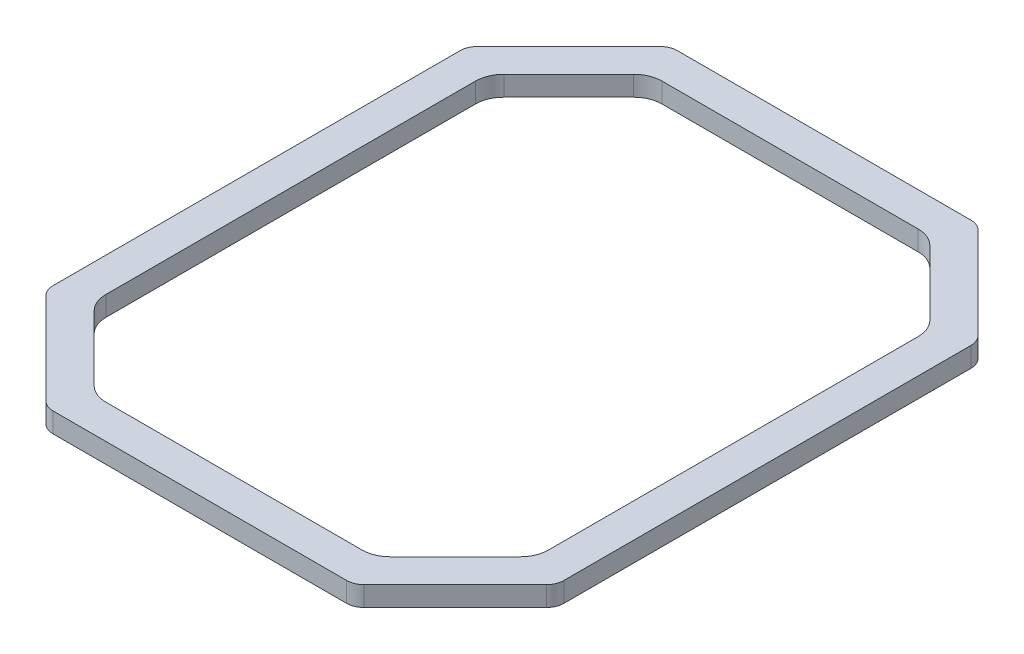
ISO-10303-21;
HEADER;
FILE_DESCRIPTION(('STEP AP214'),'2;1');
FILE_NAME('part.step','',(''),(''),'','','');
FILE_SCHEMA(('AUTOMOTIVE_DESIGN { 1 0 10303 214 1 1 1 1 }'));
ENDSEC;
DATA;
#1=APPLICATION_CONTEXT('core data for automotive mechanical design processes');
#2=APPLICATION_PROTOCOL_DEFINITION('international standard','automotive_design',2000,#1);
#3=PRODUCT_CONTEXT('',#1,'mechanical');
#4=PRODUCT('Part','Part','',(#3));
#5=PRODUCT_RELATED_PRODUCT_CATEGORY('part','',(#4));
#6=PRODUCT_DEFINITION_FORMATION('','',#4);
#7=PRODUCT_DEFINITION_CONTEXT('part definition',#1,'design');
#8=PRODUCT_DEFINITION('design','',#6,#7);
#9=PRODUCT_DEFINITION_SHAPE('','',#8);
#10=(LENGTH_UNIT() NAMED_UNIT(*) SI_UNIT(.MILLI.,.METRE.));
#11=(NAMED_UNIT(*) PLANE_ANGLE_UNIT() SI_UNIT($,.RADIAN.));
#12=(NAMED_UNIT(*) SI_UNIT($,.STERADIAN.) SOLID_ANGLE_UNIT());
#13=UNCERTAINTY_MEASURE_WITH_UNIT(LENGTH_MEASURE(1.E-05),#10,'distance_accuracy_value','');
#14=(GEOMETRIC_REPRESENTATION_CONTEXT(3) GLOBAL_UNCERTAINTY_ASSIGNED_CONTEXT((#13)) GLOBAL_UNIT_ASSIGNED_CONTEXT((#10,
#11,#12)) REPRESENTATION_CONTEXT('',''));
#15=CARTESIAN_POINT('',(0.,0.,0.));
#16=DIRECTION('',(0.,0.,1.));
#17=DIRECTION('',(1.,0.,0.));
#18=AXIS2_PLACEMENT_3D('',#15,#16,#17);
#19=CARTESIAN_POINT('',(-898.854903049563,1.75,-1730.13027438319));
#20=DIRECTION('',(0.,1.,0.));
#21=DIRECTION('',(0.,0.,1.));
#22=AXIS2_PLACEMENT_3D('',#19,#20,#21);
#23=PLANE('',#22);
#24=CARTESIAN_POINT('',(-898.854903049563,1.75,-1730.13027438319));
#25=DIRECTION('',(0.,1.,0.));
#26=DIRECTION('',(0.,0.,1.));
#27=AXIS2_PLACEMENT_3D('',#24,#25,#26);
#28=CIRCLE('',#27,1.50000000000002);
#29=CARTESIAN_POINT('',(-898.854903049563,1.75,-1731.63027438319));
#30=VERTEX_POINT('',#29);
#31=CARTESIAN_POINT('',(-899.915563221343,1.75,-1731.19093455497));
#32=VERTEX_POINT('',#31);
#33=EDGE_CURVE('E369',#30,#32,#28,.T.);
#34=ORIENTED_EDGE('',*,*,#33,.T.);
#35=DIRECTION('',(-0.707106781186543,0.,0.707106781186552));
#36=VECTOR('',#35,1.);
#37=CARTESIAN_POINT('',(-899.915563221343,1.75,-1731.19093455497));
#38=LINE('',#37,#36);
#39=CARTESIAN_POINT('',(-907.976580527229,1.75,-1723.12991724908));
#40=VERTEX_POINT('',#39);
#41=EDGE_CURVE('E372',#32,#40,#38,.T.);
#42=ORIENTED_EDGE('',*,*,#41,.T.);
#43=CARTESIAN_POINT('',(-906.915920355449,1.75,-1722.0692570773));
#44=DIRECTION('',(0.,1.,0.));
#45=DIRECTION('',(0.,0.,1.));
#46=AXIS2_PLACEMENT_3D('',#43,#44,#45);
#47=CIRCLE('',#46,1.50000000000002);
#48=CARTESIAN_POINT('',(-908.415920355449,1.75,-1722.0692570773));
#49=VERTEX_POINT('',#48);
#50=EDGE_CURVE('E375',#40,#49,#47,.T.);
#51=ORIENTED_EDGE('',*,*,#50,.T.);
#52=DIRECTION('',(0.,0.,1.));
#53=VECTOR('',#52,1.);
#54=CARTESIAN_POINT('',(-908.415920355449,1.75,-1722.0692570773));
#55=LINE('',#54,#53);
#56=CARTESIAN_POINT('',(-908.415920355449,1.75,-1686.19129168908));
#57=VERTEX_POINT('',#56);
#58=EDGE_CURVE('E377',#49,#57,#55,.T.);
#59=ORIENTED_EDGE('',*,*,#58,.T.);
#60=CARTESIAN_POINT('',(-906.915920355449,1.75,-1686.19129168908));
#61=DIRECTION('',(0.,1.,0.));
#62=DIRECTION('',(0.,0.,1.));
#63=AXIS2_PLACEMENT_3D('',#60,#61,#62);
#64=CIRCLE('',#63,1.50000000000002);
#65=CARTESIAN_POINT('',(-907.976580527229,1.75,-1685.1306315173));
#66=VERTEX_POINT('',#65);
#67=EDGE_CURVE('E379',#57,#66,#64,.T.);
#68=ORIENTED_EDGE('',*,*,#67,.T.);
#69=DIRECTION('',(0.707106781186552,0.,0.707106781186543));
#70=VECTOR('',#69,1.);
#71=CARTESIAN_POINT('',(-907.976580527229,1.75,-1685.1306315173));
#72=LINE('',#71,#70);
#73=CARTESIAN_POINT('',(-899.915563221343,1.75,-1677.06961421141));
#74=VERTEX_POINT('',#73);
#75=EDGE_CURVE('E381',#66,#74,#72,.T.);
#76=ORIENTED_EDGE('',*,*,#75,.T.);
#77=CARTESIAN_POINT('',(-898.854903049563,1.75,-1678.13027438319));
#78=DIRECTION('',(0.,1.,0.));
#79=DIRECTION('',(0.,0.,1.));
#80=AXIS2_PLACEMENT_3D('',#77,#78,#79);
#81=CIRCLE('',#80,1.50000000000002);
#82=CARTESIAN_POINT('',(-898.854903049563,1.75,-1676.63027438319));
#83=VERTEX_POINT('',#82);
#84=EDGE_CURVE('E383',#74,#83,#81,.T.);
#85=ORIENTED_EDGE('',*,*,#84,.T.);
#86=DIRECTION('',(1.,0.,0.));
#87=VECTOR('',#86,1.);
#88=CARTESIAN_POINT('',(-898.854903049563,1.75,-1676.63027438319));
#89=LINE('',#88,#87);
#90=CARTESIAN_POINT('',(-872.976937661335,1.75,-1676.63027438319));
#91=VERTEX_POINT('',#90);
#92=EDGE_CURVE('E385',#83,#91,#89,.T.);
#93=ORIENTED_EDGE('',*,*,#92,.T.);
#94=CARTESIAN_POINT('',(-872.976937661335,1.75,-1678.13027438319));
#95=DIRECTION('',(0.,1.,0.));
#96=DIRECTION('',(0.,0.,1.));
#97=AXIS2_PLACEMENT_3D('',#94,#95,#96);
#98=CIRCLE('',#97,1.50000000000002);
#99=CARTESIAN_POINT('',(-871.916277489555,1.75,-1677.06961421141));
#100=VERTEX_POINT('',#99);
#101=EDGE_CURVE('E387',#91,#100,#98,.T.);
#102=ORIENTED_EDGE('',*,*,#101,.T.);
#103=DIRECTION('',(0.707106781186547,0.,-0.707106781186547));
#104=VECTOR('',#103,1.);
#105=CARTESIAN_POINT('',(-871.916277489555,1.75,-1677.06961421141));
#106=LINE('',#105,#104);
#107=CARTESIAN_POINT('',(-863.855260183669,1.75,-1685.1306315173));
#108=VERTEX_POINT('',#107);
#109=EDGE_CURVE('E389',#100,#108,#106,.T.);
#110=ORIENTED_EDGE('',*,*,#109,.T.);
#111=CARTESIAN_POINT('',(-864.915920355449,1.75,-1686.19129168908));
#112=DIRECTION('',(0.,1.,0.));
#113=DIRECTION('',(0.,0.,1.));
#114=AXIS2_PLACEMENT_3D('',#111,#112,#113);
#115=CIRCLE('',#114,1.49999999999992);
#116=CARTESIAN_POINT('',(-863.415920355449,1.75,-1686.19129168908));
#117=VERTEX_POINT('',#116);
#118=EDGE_CURVE('E391',#108,#117,#115,.T.);
#119=ORIENTED_EDGE('',*,*,#118,.T.);
#120=DIRECTION('',(0.,0.,-1.));
#121=VECTOR('',#120,1.);
#122=CARTESIAN_POINT('',(-863.415920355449,1.75,-1686.19129168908));
#123=LINE('',#122,#121);
#124=CARTESIAN_POINT('',(-863.415920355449,1.75,-1722.0692570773));
#125=VERTEX_POINT('',#124);
#126=EDGE_CURVE('E393',#117,#125,#123,.T.);
#127=ORIENTED_EDGE('',*,*,#126,.T.);
#128=CARTESIAN_POINT('',(-864.915920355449,1.75,-1722.0692570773));
#129=DIRECTION('',(0.,1.,0.));
#130=DIRECTION('',(0.,0.,1.));
#131=AXIS2_PLACEMENT_3D('',#128,#129,#130);
#132=CIRCLE('',#131,1.5);
#133=CARTESIAN_POINT('',(-863.855260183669,1.75,-1723.12991724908));
#134=VERTEX_POINT('',#133);
#135=EDGE_CURVE('E395',#125,#134,#132,.T.);
#136=ORIENTED_EDGE('',*,*,#135,.T.);
#137=DIRECTION('',(-0.707106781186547,0.,-0.707106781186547));
#138=VECTOR('',#137,1.);
#139=CARTESIAN_POINT('',(-863.855260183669,1.75,-1723.12991724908));
#140=LINE('',#139,#138);
#141=CARTESIAN_POINT('',(-871.916277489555,1.75,-1731.19093455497));
#142=VERTEX_POINT('',#141);
#143=EDGE_CURVE('E397',#134,#142,#140,.T.);
#144=ORIENTED_EDGE('',*,*,#143,.T.);
#145=CARTESIAN_POINT('',(-872.976937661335,1.75,-1730.13027438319));
#146=DIRECTION('',(0.,1.,0.));
#147=DIRECTION('',(0.,0.,1.));
#148=AXIS2_PLACEMENT_3D('',#145,#146,#147);
#149=CIRCLE('',#148,1.50000000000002);
#150=CARTESIAN_POINT('',(-872.976937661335,1.75,-1731.63027438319));
#151=VERTEX_POINT('',#150);
#152=EDGE_CURVE('E399',#142,#151,#149,.T.);
#153=ORIENTED_EDGE('',*,*,#152,.T.);
#154=DIRECTION('',(-1.,0.,0.));
#155=VECTOR('',#154,1.);
#156=CARTESIAN_POINT('',(-872.976937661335,1.75,-1731.63027438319));
#157=LINE('',#156,#155);
#158=EDGE_CURVE('E401',#151,#30,#157,.T.);
#159=ORIENTED_EDGE('',*,*,#158,.T.);
#160=EDGE_LOOP('',(#34,#42,#51,#59,#68,#76,#85,#93,#102,#110,#119,#127,#136,#144,#153,#159));
#161=FACE_BOUND('',#160,.T.);
#162=DIRECTION('',(-0.707106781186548,0.,0.707106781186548));
#163=VECTOR('',#162,1.);
#164=CARTESIAN_POINT('',(-898.965815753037,1.75,-1727.89804133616));
#165=LINE('',#164,#163);
#166=CARTESIAN_POINT('',(-898.965815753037,1.75,-1727.89804133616));
#167=VERTEX_POINT('',#166);
#168=CARTESIAN_POINT('',(-904.683687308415,1.75,-1722.18016978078));
#169=VERTEX_POINT('',#168);
#170=EDGE_CURVE('E256',#167,#169,#165,.T.);
#171=ORIENTED_EDGE('',*,*,#170,.F.);
#172=CARTESIAN_POINT('',(-897.198048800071,1.75,-1726.13027438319));
#173=DIRECTION('',(0.,1.,0.));
#174=DIRECTION('',(0.,0.,1.));
#175=AXIS2_PLACEMENT_3D('',#172,#173,#174);
#176=CIRCLE('',#175,2.49999999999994);
#177=CARTESIAN_POINT('',(-897.198048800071,1.75,-1728.63027438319));
#178=VERTEX_POINT('',#177);
#179=EDGE_CURVE('E248',#178,#167,#176,.T.);
#180=ORIENTED_EDGE('',*,*,#179,.F.);
#181=DIRECTION('',(-1.,0.,0.));
#182=VECTOR('',#181,1.);
#183=CARTESIAN_POINT('',(-874.633791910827,1.75,-1728.63027438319));
#184=LINE('',#183,#182);
#185=CARTESIAN_POINT('',(-874.633791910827,1.75,-1728.63027438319));
#186=VERTEX_POINT('',#185);
#187=EDGE_CURVE('E297',#186,#178,#184,.T.);
#188=ORIENTED_EDGE('',*,*,#187,.F.);
#189=CARTESIAN_POINT('',(-874.633791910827,1.75,-1726.13027438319));
#190=DIRECTION('',(0.,1.,0.));
#191=DIRECTION('',(0.,0.,1.));
#192=AXIS2_PLACEMENT_3D('',#189,#190,#191);
#193=CIRCLE('',#192,2.49999999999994);
#194=CARTESIAN_POINT('',(-872.866024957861,1.75,-1727.89804133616));
#195=VERTEX_POINT('',#194);
#196=EDGE_CURVE('E295',#195,#186,#193,.T.);
#197=ORIENTED_EDGE('',*,*,#196,.F.);
#198=DIRECTION('',(-0.707106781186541,0.,-0.707106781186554));
#199=VECTOR('',#198,1.);
#200=CARTESIAN_POINT('',(-867.148153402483,1.75,-1722.18016978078));
#201=LINE('',#200,#199);
#202=CARTESIAN_POINT('',(-867.148153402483,1.75,-1722.18016978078));
#203=VERTEX_POINT('',#202);
#204=EDGE_CURVE('E293',#203,#195,#201,.T.);
#205=ORIENTED_EDGE('',*,*,#204,.F.);
#206=CARTESIAN_POINT('',(-868.915920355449,1.75,-1720.41240282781));
#207=DIRECTION('',(0.,1.,0.));
#208=DIRECTION('',(0.,0.,1.));
#209=AXIS2_PLACEMENT_3D('',#206,#207,#208);
#210=CIRCLE('',#209,2.49999999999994);
#211=CARTESIAN_POINT('',(-866.415920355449,1.75,-1720.41240282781));
#212=VERTEX_POINT('',#211);
#213=EDGE_CURVE('E291',#212,#203,#210,.T.);
#214=ORIENTED_EDGE('',*,*,#213,.F.);
#215=DIRECTION('',(0.,0.,-1.));
#216=VECTOR('',#215,1.);
#217=CARTESIAN_POINT('',(-866.415920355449,1.75,-1687.84814593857));
#218=LINE('',#217,#216);
#219=CARTESIAN_POINT('',(-866.415920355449,1.75,-1687.84814593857));
#220=VERTEX_POINT('',#219);
#221=EDGE_CURVE('E289',#220,#212,#218,.T.);
#222=ORIENTED_EDGE('',*,*,#221,.F.);
#223=CARTESIAN_POINT('',(-868.915920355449,1.75,-1687.84814593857));
#224=DIRECTION('',(0.,1.,0.));
#225=DIRECTION('',(0.,0.,1.));
#226=AXIS2_PLACEMENT_3D('',#223,#224,#225);
#227=CIRCLE('',#226,2.50000000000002);
#228=CARTESIAN_POINT('',(-867.148153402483,1.75,-1686.0803789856));
#229=VERTEX_POINT('',#228);
#230=EDGE_CURVE('E287',#229,#220,#227,.T.);
#231=ORIENTED_EDGE('',*,*,#230,.F.);
#232=DIRECTION('',(0.707106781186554,0.,-0.707106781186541));
#233=VECTOR('',#232,1.);
#234=CARTESIAN_POINT('',(-872.866024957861,1.75,-1680.36250743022));
#235=LINE('',#234,#233);
#236=CARTESIAN_POINT('',(-872.866024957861,1.75,-1680.36250743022));
#237=VERTEX_POINT('',#236);
#238=EDGE_CURVE('E285',#237,#229,#235,.T.);
#239=ORIENTED_EDGE('',*,*,#238,.F.);
#240=CARTESIAN_POINT('',(-874.633791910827,1.75,-1682.13027438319));
#241=DIRECTION('',(0.,1.,0.));
#242=DIRECTION('',(0.,0.,1.));
#243=AXIS2_PLACEMENT_3D('',#240,#241,#242);
#244=CIRCLE('',#243,2.49999999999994);
#245=CARTESIAN_POINT('',(-874.633791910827,1.75,-1679.63027438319));
#246=VERTEX_POINT('',#245);
#247=EDGE_CURVE('E283',#246,#237,#244,.T.);
#248=ORIENTED_EDGE('',*,*,#247,.F.);
#249=DIRECTION('',(1.,0.,0.));
#250=VECTOR('',#249,1.);
#251=CARTESIAN_POINT('',(-897.198048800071,1.75,-1679.63027438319));
#252=LINE('',#251,#250);
#253=CARTESIAN_POINT('',(-897.198048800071,1.75,-1679.63027438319));
#254=VERTEX_POINT('',#253);
#255=EDGE_CURVE('E281',#254,#246,#252,.T.);
#256=ORIENTED_EDGE('',*,*,#255,.F.);
#257=CARTESIAN_POINT('',(-897.198048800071,1.75,-1682.13027438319));
#258=DIRECTION('',(0.,1.,0.));
#259=DIRECTION('',(0.,0.,1.));
#260=AXIS2_PLACEMENT_3D('',#257,#258,#259);
#261=CIRCLE('',#260,2.49999999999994);
#262=CARTESIAN_POINT('',(-898.965815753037,1.75,-1680.36250743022));
#263=VERTEX_POINT('',#262);
#264=EDGE_CURVE('E279',#263,#254,#261,.T.);
#265=ORIENTED_EDGE('',*,*,#264,.F.);
#266=DIRECTION('',(0.707106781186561,0.,0.707106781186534));
#267=VECTOR('',#266,1.);
#268=CARTESIAN_POINT('',(-904.683687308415,1.75,-1686.0803789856));
#269=LINE('',#268,#267);
#270=CARTESIAN_POINT('',(-904.683687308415,1.75,-1686.0803789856));
#271=VERTEX_POINT('',#270);
#272=EDGE_CURVE('E277',#271,#263,#269,.T.);
#273=ORIENTED_EDGE('',*,*,#272,.F.);
#274=CARTESIAN_POINT('',(-902.915920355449,1.75,-1687.84814593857));
#275=DIRECTION('',(0.,1.,0.));
#276=DIRECTION('',(0.,0.,1.));
#277=AXIS2_PLACEMENT_3D('',#274,#275,#276);
#278=CIRCLE('',#277,2.50000000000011);
#279=CARTESIAN_POINT('',(-905.415920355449,1.75,-1687.84814593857));
#280=VERTEX_POINT('',#279);
#281=EDGE_CURVE('E275',#280,#271,#278,.T.);
#282=ORIENTED_EDGE('',*,*,#281,.F.);
#283=DIRECTION('',(0.,0.,1.));
#284=VECTOR('',#283,1.);
#285=CARTESIAN_POINT('',(-905.415920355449,1.75,-1720.41240282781));
#286=LINE('',#285,#284);
#287=CARTESIAN_POINT('',(-905.415920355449,1.75,-1720.41240282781));
#288=VERTEX_POINT('',#287);
#289=EDGE_CURVE('E271',#288,#280,#286,.T.);
#290=ORIENTED_EDGE('',*,*,#289,.F.);
#291=CARTESIAN_POINT('',(-902.915920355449,1.75,-1720.41240282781));
#292=DIRECTION('',(0.,1.,0.));
#293=DIRECTION('',(0.,0.,1.));
#294=AXIS2_PLACEMENT_3D('',#291,#292,#293);
#295=CIRCLE('',#294,2.50000000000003);
#296=EDGE_CURVE('E269',#169,#288,#295,.T.);
#297=ORIENTED_EDGE('',*,*,#296,.F.);
#298=EDGE_LOOP('',(#171,#180,#188,#197,#205,#214,#222,#231,#239,#248,#256,#265,#273,#282,#290,#297));
#299=FACE_BOUND('',#298,.T.);
#300=ADVANCED_FACE('F39',(#161,#299),#23,.T.);
#301=CARTESIAN_POINT('',(-898.854903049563,0.,-1730.13027438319));
#302=DIRECTION('',(0.,1.,0.));
#303=DIRECTION('',(0.,0.,1.));
#304=AXIS2_PLACEMENT_3D('',#301,#302,#303);
#305=PLANE('',#304);
#306=CARTESIAN_POINT('',(-898.854903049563,0.,-1730.13027438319));
#307=DIRECTION('',(0.,1.,0.));
#308=DIRECTION('',(0.,0.,1.));
#309=AXIS2_PLACEMENT_3D('',#306,#307,#308);
#310=CIRCLE('',#309,1.50000000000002);
#311=CARTESIAN_POINT('',(-898.854903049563,0.,-1731.63027438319));
#312=VERTEX_POINT('',#311);
#313=CARTESIAN_POINT('',(-899.915563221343,0.,-1731.19093455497));
#314=VERTEX_POINT('',#313);
#315=EDGE_CURVE('E264',#312,#314,#310,.T.);
#316=ORIENTED_EDGE('',*,*,#315,.F.);
#317=DIRECTION('',(-1.,0.,0.));
#318=VECTOR('',#317,1.);
#319=CARTESIAN_POINT('',(-872.976937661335,0.,-1731.63027438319));
#320=LINE('',#319,#318);
#321=CARTESIAN_POINT('',(-872.976937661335,0.,-1731.63027438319));
#322=VERTEX_POINT('',#321);
#323=EDGE_CURVE('E373',#322,#312,#320,.T.);
#324=ORIENTED_EDGE('',*,*,#323,.F.);
#325=CARTESIAN_POINT('',(-872.976937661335,0.,-1730.13027438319));
#326=DIRECTION('',(0.,1.,0.));
#327=DIRECTION('',(0.,0.,1.));
#328=AXIS2_PLACEMENT_3D('',#325,#326,#327);
#329=CIRCLE('',#328,1.50000000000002);
#330=CARTESIAN_POINT('',(-871.916277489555,0.,-1731.19093455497));
#331=VERTEX_POINT('',#330);
#332=EDGE_CURVE('E432',#331,#322,#329,.T.);
#333=ORIENTED_EDGE('',*,*,#332,.F.);
#334=DIRECTION('',(-0.707106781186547,0.,-0.707106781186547));
#335=VECTOR('',#334,1.);
#336=CARTESIAN_POINT('',(-863.855260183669,0.,-1723.12991724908));
#337=LINE('',#336,#335);
#338=CARTESIAN_POINT('',(-863.855260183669,0.,-1723.12991724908));
#339=VERTEX_POINT('',#338);
#340=EDGE_CURVE('E430',#339,#331,#337,.T.);
#341=ORIENTED_EDGE('',*,*,#340,.F.);
#342=CARTESIAN_POINT('',(-864.915920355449,0.,-1722.0692570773));
#343=DIRECTION('',(0.,1.,0.));
#344=DIRECTION('',(0.,0.,1.));
#345=AXIS2_PLACEMENT_3D('',#342,#343,#344);
#346=CIRCLE('',#345,1.5);
#347=CARTESIAN_POINT('',(-863.415920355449,0.,-1722.0692570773));
#348=VERTEX_POINT('',#347);
#349=EDGE_CURVE('E428',#348,#339,#346,.T.);
#350=ORIENTED_EDGE('',*,*,#349,.F.);
#351=DIRECTION('',(0.,0.,-1.));
#352=VECTOR('',#351,1.);
#353=CARTESIAN_POINT('',(-863.415920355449,0.,-1686.19129168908));
#354=LINE('',#353,#352);
#355=CARTESIAN_POINT('',(-863.415920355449,0.,-1686.19129168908));
#356=VERTEX_POINT('',#355);
#357=EDGE_CURVE('E426',#356,#348,#354,.T.);
#358=ORIENTED_EDGE('',*,*,#357,.F.);
#359=CARTESIAN_POINT('',(-864.915920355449,0.,-1686.19129168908));
#360=DIRECTION('',(0.,1.,0.));
#361=DIRECTION('',(0.,0.,1.));
#362=AXIS2_PLACEMENT_3D('',#359,#360,#361);
#363=CIRCLE('',#362,1.49999999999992);
#364=CARTESIAN_POINT('',(-863.855260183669,0.,-1685.1306315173));
#365=VERTEX_POINT('',#364);
#366=EDGE_CURVE('E424',#365,#356,#363,.T.);
#367=ORIENTED_EDGE('',*,*,#366,.F.);
#368=DIRECTION('',(0.707106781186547,0.,-0.707106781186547));
#369=VECTOR('',#368,1.);
#370=CARTESIAN_POINT('',(-871.916277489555,0.,-1677.06961421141));
#371=LINE('',#370,#369);
#372=CARTESIAN_POINT('',(-871.916277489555,0.,-1677.06961421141));
#373=VERTEX_POINT('',#372);
#374=EDGE_CURVE('E422',#373,#365,#371,.T.);
#375=ORIENTED_EDGE('',*,*,#374,.F.);
#376=CARTESIAN_POINT('',(-872.976937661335,0.,-1678.13027438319));
#377=DIRECTION('',(0.,1.,0.));
#378=DIRECTION('',(0.,0.,1.));
#379=AXIS2_PLACEMENT_3D('',#376,#377,#378);
#380=CIRCLE('',#379,1.50000000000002);
#381=CARTESIAN_POINT('',(-872.976937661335,0.,-1676.63027438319));
#382=VERTEX_POINT('',#381);
#383=EDGE_CURVE('E420',#382,#373,#380,.T.);
#384=ORIENTED_EDGE('',*,*,#383,.F.);
#385=DIRECTION('',(1.,0.,0.));
#386=VECTOR('',#385,1.);
#387=CARTESIAN_POINT('',(-898.854903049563,0.,-1676.63027438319));
#388=LINE('',#387,#386);
#389=CARTESIAN_POINT('',(-898.854903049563,0.,-1676.63027438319));
#390=VERTEX_POINT('',#389);
#391=EDGE_CURVE('E418',#390,#382,#388,.T.);
#392=ORIENTED_EDGE('',*,*,#391,.F.);
#393=CARTESIAN_POINT('',(-898.854903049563,0.,-1678.13027438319));
#394=DIRECTION('',(0.,1.,0.));
#395=DIRECTION('',(0.,0.,1.));
#396=AXIS2_PLACEMENT_3D('',#393,#394,#395);
#397=CIRCLE('',#396,1.50000000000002);
#398=CARTESIAN_POINT('',(-899.915563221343,0.,-1677.06961421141));
#399=VERTEX_POINT('',#398);
#400=EDGE_CURVE('E416',#399,#390,#397,.T.);
#401=ORIENTED_EDGE('',*,*,#400,.F.);
#402=DIRECTION('',(0.707106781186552,0.,0.707106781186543));
#403=VECTOR('',#402,1.);
#404=CARTESIAN_POINT('',(-907.976580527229,0.,-1685.1306315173));
#405=LINE('',#404,#403);
#406=CARTESIAN_POINT('',(-907.976580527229,0.,-1685.1306315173));
#407=VERTEX_POINT('',#406);
#408=EDGE_CURVE('E414',#407,#399,#405,.T.);
#409=ORIENTED_EDGE('',*,*,#408,.F.);
#410=CARTESIAN_POINT('',(-906.915920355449,0.,-1686.19129168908));
#411=DIRECTION('',(0.,1.,0.));
#412=DIRECTION('',(0.,0.,1.));
#413=AXIS2_PLACEMENT_3D('',#410,#411,#412);
#414=CIRCLE('',#413,1.50000000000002);
#415=CARTESIAN_POINT('',(-908.415920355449,0.,-1686.19129168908));
#416=VERTEX_POINT('',#415);
#417=EDGE_CURVE('E412',#416,#407,#414,.T.);
#418=ORIENTED_EDGE('',*,*,#417,.F.);
#419=DIRECTION('',(0.,0.,1.));
#420=VECTOR('',#419,1.);
#421=CARTESIAN_POINT('',(-908.415920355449,0.,-1722.0692570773));
#422=LINE('',#421,#420);
#423=CARTESIAN_POINT('',(-908.415920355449,0.,-1722.0692570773));
#424=VERTEX_POINT('',#423);
#425=EDGE_CURVE('E410',#424,#416,#422,.T.);
#426=ORIENTED_EDGE('',*,*,#425,.F.);
#427=CARTESIAN_POINT('',(-906.915920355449,0.,-1722.0692570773));
#428=DIRECTION('',(0.,1.,0.));
#429=DIRECTION('',(0.,0.,1.));
#430=AXIS2_PLACEMENT_3D('',#427,#428,#429);
#431=CIRCLE('',#430,1.50000000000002);
#432=CARTESIAN_POINT('',(-907.976580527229,0.,-1723.12991724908));
#433=VERTEX_POINT('',#432);
#434=EDGE_CURVE('E408',#433,#424,#431,.T.);
#435=ORIENTED_EDGE('',*,*,#434,.F.);
#436=DIRECTION('',(-0.707106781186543,0.,0.707106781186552));
#437=VECTOR('',#436,1.);
#438=CARTESIAN_POINT('',(-899.915563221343,0.,-1731.19093455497));
#439=LINE('',#438,#437);
#440=EDGE_CURVE('E406',#314,#433,#439,.T.);
#441=ORIENTED_EDGE('',*,*,#440,.F.);
#442=EDGE_LOOP('',(#316,#324,#333,#341,#350,#358,#367,#375,#384,#392,#401,#409,#418,#426,#435,#441));
#443=FACE_BOUND('',#442,.T.);
#444=CARTESIAN_POINT('',(-897.198048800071,0.,-1726.13027438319));
#445=DIRECTION('',(0.,1.,0.));
#446=DIRECTION('',(0.,0.,1.));
#447=AXIS2_PLACEMENT_3D('',#444,#445,#446);
#448=CIRCLE('',#447,2.49999999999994);
#449=CARTESIAN_POINT('',(-897.198048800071,0.,-1728.63027438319));
#450=VERTEX_POINT('',#449);
#451=CARTESIAN_POINT('',(-898.965815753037,0.,-1727.89804133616));
#452=VERTEX_POINT('',#451);
#453=EDGE_CURVE('E62',#450,#452,#448,.T.);
#454=ORIENTED_EDGE('',*,*,#453,.T.);
#455=DIRECTION('',(-0.707106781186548,0.,0.707106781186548));
#456=VECTOR('',#455,1.);
#457=CARTESIAN_POINT('',(-898.965815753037,0.,-1727.89804133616));
#458=LINE('',#457,#456);
#459=CARTESIAN_POINT('',(-904.683687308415,0.,-1722.18016978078));
#460=VERTEX_POINT('',#459);
#461=EDGE_CURVE('E263',#452,#460,#458,.T.);
#462=ORIENTED_EDGE('',*,*,#461,.T.);
#463=CARTESIAN_POINT('',(-902.915920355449,0.,-1720.41240282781));
#464=DIRECTION('',(0.,1.,0.));
#465=DIRECTION('',(0.,0.,1.));
#466=AXIS2_PLACEMENT_3D('',#463,#464,#465);
#467=CIRCLE('',#466,2.50000000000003);
#468=CARTESIAN_POINT('',(-905.415920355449,0.,-1720.41240282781));
#469=VERTEX_POINT('',#468);
#470=EDGE_CURVE('E301',#460,#469,#467,.T.);
#471=ORIENTED_EDGE('',*,*,#470,.T.);
#472=DIRECTION('',(0.,0.,1.));
#473=VECTOR('',#472,1.);
#474=CARTESIAN_POINT('',(-905.415920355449,0.,-1720.41240282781));
#475=LINE('',#474,#473);
#476=CARTESIAN_POINT('',(-905.415920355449,0.,-1687.84814593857));
#477=VERTEX_POINT('',#476);
#478=EDGE_CURVE('E304',#469,#477,#475,.T.);
#479=ORIENTED_EDGE('',*,*,#478,.T.);
#480=CARTESIAN_POINT('',(-902.915920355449,0.,-1687.84814593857));
#481=DIRECTION('',(0.,1.,0.));
#482=DIRECTION('',(0.,0.,1.));
#483=AXIS2_PLACEMENT_3D('',#480,#481,#482);
#484=CIRCLE('',#483,2.50000000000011);
#485=CARTESIAN_POINT('',(-904.683687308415,0.,-1686.0803789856));
#486=VERTEX_POINT('',#485);
#487=EDGE_CURVE('E307',#477,#486,#484,.T.);
#488=ORIENTED_EDGE('',*,*,#487,.T.);
#489=DIRECTION('',(0.707106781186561,0.,0.707106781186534));
#490=VECTOR('',#489,1.);
#491=CARTESIAN_POINT('',(-904.683687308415,0.,-1686.0803789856));
#492=LINE('',#491,#490);
#493=CARTESIAN_POINT('',(-898.965815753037,0.,-1680.36250743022));
#494=VERTEX_POINT('',#493);
#495=EDGE_CURVE('E310',#486,#494,#492,.T.);
#496=ORIENTED_EDGE('',*,*,#495,.T.);
#497=CARTESIAN_POINT('',(-897.198048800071,0.,-1682.13027438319));
#498=DIRECTION('',(0.,1.,0.));
#499=DIRECTION('',(0.,0.,1.));
#500=AXIS2_PLACEMENT_3D('',#497,#498,#499);
#501=CIRCLE('',#500,2.49999999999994);
#502=CARTESIAN_POINT('',(-897.198048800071,0.,-1679.63027438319));
#503=VERTEX_POINT('',#502);
#504=EDGE_CURVE('E313',#494,#503,#501,.T.);
#505=ORIENTED_EDGE('',*,*,#504,.T.);
#506=DIRECTION('',(1.,0.,0.));
#507=VECTOR('',#506,1.);
#508=CARTESIAN_POINT('',(-897.198048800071,0.,-1679.63027438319));
#509=LINE('',#508,#507);
#510=CARTESIAN_POINT('',(-874.633791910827,0.,-1679.63027438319));
#511=VERTEX_POINT('',#510);
#512=EDGE_CURVE('E316',#503,#511,#509,.T.);
#513=ORIENTED_EDGE('',*,*,#512,.T.);
#514=CARTESIAN_POINT('',(-874.633791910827,0.,-1682.13027438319));
#515=DIRECTION('',(0.,1.,0.));
#516=DIRECTION('',(0.,0.,1.));
#517=AXIS2_PLACEMENT_3D('',#514,#515,#516);
#518=CIRCLE('',#517,2.49999999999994);
#519=CARTESIAN_POINT('',(-872.866024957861,0.,-1680.36250743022));
#520=VERTEX_POINT('',#519);
#521=EDGE_CURVE('E319',#511,#520,#518,.T.);
#522=ORIENTED_EDGE('',*,*,#521,.T.);
#523=DIRECTION('',(0.707106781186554,0.,-0.707106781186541));
#524=VECTOR('',#523,1.);
#525=CARTESIAN_POINT('',(-872.866024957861,0.,-1680.36250743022));
#526=LINE('',#525,#524);
#527=CARTESIAN_POINT('',(-867.148153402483,0.,-1686.0803789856));
#528=VERTEX_POINT('',#527);
#529=EDGE_CURVE('E322',#520,#528,#526,.T.);
#530=ORIENTED_EDGE('',*,*,#529,.T.);
#531=CARTESIAN_POINT('',(-868.915920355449,0.,-1687.84814593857));
#532=DIRECTION('',(0.,1.,0.));
#533=DIRECTION('',(0.,0.,1.));
#534=AXIS2_PLACEMENT_3D('',#531,#532,#533);
#535=CIRCLE('',#534,2.50000000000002);
#536=CARTESIAN_POINT('',(-866.415920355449,0.,-1687.84814593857));
#537=VERTEX_POINT('',#536);
#538=EDGE_CURVE('E325',#528,#537,#535,.T.);
#539=ORIENTED_EDGE('',*,*,#538,.T.);
#540=DIRECTION('',(0.,0.,-1.));
#541=VECTOR('',#540,1.);
#542=CARTESIAN_POINT('',(-866.415920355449,0.,-1687.84814593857));
#543=LINE('',#542,#541);
#544=CARTESIAN_POINT('',(-866.415920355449,0.,-1720.41240282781));
#545=VERTEX_POINT('',#544);
#546=EDGE_CURVE('E328',#537,#545,#543,.T.);
#547=ORIENTED_EDGE('',*,*,#546,.T.);
#548=CARTESIAN_POINT('',(-868.915920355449,0.,-1720.41240282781));
#549=DIRECTION('',(0.,1.,0.));
#550=DIRECTION('',(0.,0.,1.));
#551=AXIS2_PLACEMENT_3D('',#548,#549,#550);
#552=CIRCLE('',#551,2.49999999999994);
#553=CARTESIAN_POINT('',(-867.148153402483,0.,-1722.18016978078));
#554=VERTEX_POINT('',#553);
#555=EDGE_CURVE('E331',#545,#554,#552,.T.);
#556=ORIENTED_EDGE('',*,*,#555,.T.);
#557=DIRECTION('',(-0.707106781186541,0.,-0.707106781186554));
#558=VECTOR('',#557,1.);
#559=CARTESIAN_POINT('',(-867.148153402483,0.,-1722.18016978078));
#560=LINE('',#559,#558);
#561=CARTESIAN_POINT('',(-872.866024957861,0.,-1727.89804133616));
#562=VERTEX_POINT('',#561);
#563=EDGE_CURVE('E334',#554,#562,#560,.T.);
#564=ORIENTED_EDGE('',*,*,#563,.T.);
#565=CARTESIAN_POINT('',(-874.633791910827,0.,-1726.13027438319));
#566=DIRECTION('',(0.,1.,0.));
#567=DIRECTION('',(0.,0.,1.));
#568=AXIS2_PLACEMENT_3D('',#565,#566,#567);
#569=CIRCLE('',#568,2.49999999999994);
#570=CARTESIAN_POINT('',(-874.633791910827,0.,-1728.63027438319));
#571=VERTEX_POINT('',#570);
#572=EDGE_CURVE('E337',#562,#571,#569,.T.);
#573=ORIENTED_EDGE('',*,*,#572,.T.);
#574=DIRECTION('',(-1.,0.,0.));
#575=VECTOR('',#574,1.);
#576=CARTESIAN_POINT('',(-874.633791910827,0.,-1728.63027438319));
#577=LINE('',#576,#575);
#578=EDGE_CURVE('E257',#571,#450,#577,.T.);
#579=ORIENTED_EDGE('',*,*,#578,.T.);
#580=EDGE_LOOP('',(#454,#462,#471,#479,#488,#496,#505,#513,#522,#530,#539,#547,#556,#564,#573,#579));
#581=FACE_BOUND('',#580,.T.);
#582=ADVANCED_FACE('F486',(#443,#581),#305,.F.);
#583=CARTESIAN_POINT('',(-898.854903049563,1.75,-1730.13027438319));
#584=DIRECTION('',(0.,-1.,0.));
#585=DIRECTION('',(0.,0.,-1.));
#586=AXIS2_PLACEMENT_3D('',#583,#584,#585);
#587=CYLINDRICAL_SURFACE('',#586,1.50000000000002);
#588=ORIENTED_EDGE('',*,*,#315,.T.);
#589=DIRECTION('',(0.,-1.,0.));
#590=VECTOR('',#589,1.);
#591=CARTESIAN_POINT('',(-899.915563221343,1.75,-1731.19093455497));
#592=LINE('',#591,#590);
#593=EDGE_CURVE('E11',#32,#314,#592,.T.);
#594=ORIENTED_EDGE('',*,*,#593,.F.);
#595=ORIENTED_EDGE('',*,*,#33,.F.);
#596=DIRECTION('',(0.,-1.,0.));
#597=VECTOR('',#596,1.);
#598=CARTESIAN_POINT('',(-898.854903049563,1.75,-1731.63027438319));
#599=LINE('',#598,#597);
#600=EDGE_CURVE('E403',#30,#312,#599,.T.);
#601=ORIENTED_EDGE('',*,*,#600,.T.);
#602=EDGE_LOOP('',(#588,#594,#595,#601));
#603=FACE_BOUND('',#602,.T.);
#604=ADVANCED_FACE('F41',(#603),#587,.T.);
#605=CARTESIAN_POINT('',(-899.915563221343,1.75,-1731.19093455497));
#606=DIRECTION('',(0.707106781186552,0.,0.707106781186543));
#607=DIRECTION('',(0.707106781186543,0.,-0.707106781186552));
#608=AXIS2_PLACEMENT_3D('',#605,#606,#607);
#609=PLANE('',#608);
#610=ORIENTED_EDGE('',*,*,#440,.T.);
#611=DIRECTION('',(0.,-1.,0.));
#612=VECTOR('',#611,1.);
#613=CARTESIAN_POINT('',(-907.976580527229,1.75,-1723.12991724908));
#614=LINE('',#613,#612);
#615=EDGE_CURVE('E47',#40,#433,#614,.T.);
#616=ORIENTED_EDGE('',*,*,#615,.F.);
#617=ORIENTED_EDGE('',*,*,#41,.F.);
#618=ORIENTED_EDGE('',*,*,#593,.T.);
#619=EDGE_LOOP('',(#610,#616,#617,#618));
#620=FACE_BOUND('',#619,.T.);
#621=ADVANCED_FACE('F503',(#620),#609,.F.);
#622=CARTESIAN_POINT('',(-906.915920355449,1.75,-1722.0692570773));
#623=DIRECTION('',(0.,-1.,0.));
#624=DIRECTION('',(0.,0.,-1.));
#625=AXIS2_PLACEMENT_3D('',#622,#623,#624);
#626=CYLINDRICAL_SURFACE('',#625,1.50000000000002);
#627=ORIENTED_EDGE('',*,*,#434,.T.);
#628=DIRECTION('',(0.,-1.,0.));
#629=VECTOR('',#628,1.);
#630=CARTESIAN_POINT('',(-908.415920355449,1.75,-1722.0692570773));
#631=LINE('',#630,#629);
#632=EDGE_CURVE('E473',#49,#424,#631,.T.);
#633=ORIENTED_EDGE('',*,*,#632,.F.);
#634=ORIENTED_EDGE('',*,*,#50,.F.);
#635=ORIENTED_EDGE('',*,*,#615,.T.);
#636=EDGE_LOOP('',(#627,#633,#634,#635));
#637=FACE_BOUND('',#636,.T.);
#638=ADVANCED_FACE('F480',(#637),#626,.T.);
#639=CARTESIAN_POINT('',(-908.415920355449,1.75,-1722.0692570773));
#640=DIRECTION('',(1.,0.,0.));
#641=DIRECTION('',(0.,0.,-1.));
#642=AXIS2_PLACEMENT_3D('',#639,#640,#641);
#643=PLANE('',#642);
#644=ORIENTED_EDGE('',*,*,#425,.T.);
#645=DIRECTION('',(0.,-1.,0.));
#646=VECTOR('',#645,1.);
#647=CARTESIAN_POINT('',(-908.415920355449,1.75,-1686.19129168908));
#648=LINE('',#647,#646);
#649=EDGE_CURVE('E470',#57,#416,#648,.T.);
#650=ORIENTED_EDGE('',*,*,#649,.F.);
#651=ORIENTED_EDGE('',*,*,#58,.F.);
#652=ORIENTED_EDGE('',*,*,#632,.T.);
#653=EDGE_LOOP('',(#644,#650,#651,#652));
#654=FACE_BOUND('',#653,.T.);
#655=ADVANCED_FACE('F492',(#654),#643,.F.);
#656=CARTESIAN_POINT('',(-906.915920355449,1.75,-1686.19129168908));
#657=DIRECTION('',(0.,-1.,0.));
#658=DIRECTION('',(0.,0.,-1.));
#659=AXIS2_PLACEMENT_3D('',#656,#657,#658);
#660=CYLINDRICAL_SURFACE('',#659,1.50000000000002);
#661=ORIENTED_EDGE('',*,*,#417,.T.);
#662=DIRECTION('',(0.,-1.,0.));
#663=VECTOR('',#662,1.);
#664=CARTESIAN_POINT('',(-907.976580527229,1.75,-1685.1306315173));
#665=LINE('',#664,#663);
#666=EDGE_CURVE('E467',#66,#407,#665,.T.);
#667=ORIENTED_EDGE('',*,*,#666,.F.);
#668=ORIENTED_EDGE('',*,*,#67,.F.);
#669=ORIENTED_EDGE('',*,*,#649,.T.);
#670=EDGE_LOOP('',(#661,#667,#668,#669));
#671=FACE_BOUND('',#670,.T.);
#672=ADVANCED_FACE('F496',(#671),#660,.T.);
#673=CARTESIAN_POINT('',(-907.976580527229,1.75,-1685.1306315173));
#674=DIRECTION('',(0.707106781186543,0.,-0.707106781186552));
#675=DIRECTION('',(-0.707106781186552,0.,-0.707106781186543));
#676=AXIS2_PLACEMENT_3D('',#673,#674,#675);
#677=PLANE('',#676);
#678=ORIENTED_EDGE('',*,*,#408,.T.);
#679=DIRECTION('',(0.,-1.,0.));
#680=VECTOR('',#679,1.);
#681=CARTESIAN_POINT('',(-899.915563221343,1.75,-1677.06961421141));
#682=LINE('',#681,#680);
#683=EDGE_CURVE('E464',#74,#399,#682,.T.);
#684=ORIENTED_EDGE('',*,*,#683,.F.);
#685=ORIENTED_EDGE('',*,*,#75,.F.);
#686=ORIENTED_EDGE('',*,*,#666,.T.);
#687=EDGE_LOOP('',(#678,#684,#685,#686));
#688=FACE_BOUND('',#687,.T.);
#689=ADVANCED_FACE('F556',(#688),#677,.F.);
#690=CARTESIAN_POINT('',(-898.854903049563,1.75,-1678.13027438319));
#691=DIRECTION('',(0.,-1.,0.));
#692=DIRECTION('',(0.,0.,-1.));
#693=AXIS2_PLACEMENT_3D('',#690,#691,#692);
#694=CYLINDRICAL_SURFACE('',#693,1.50000000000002);
#695=ORIENTED_EDGE('',*,*,#400,.T.);
#696=DIRECTION('',(0.,-1.,0.));
#697=VECTOR('',#696,1.);
#698=CARTESIAN_POINT('',(-898.854903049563,1.75,-1676.63027438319));
#699=LINE('',#698,#697);
#700=EDGE_CURVE('E461',#83,#390,#699,.T.);
#701=ORIENTED_EDGE('',*,*,#700,.F.);
#702=ORIENTED_EDGE('',*,*,#84,.F.);
#703=ORIENTED_EDGE('',*,*,#683,.T.);
#704=EDGE_LOOP('',(#695,#701,#702,#703));
#705=FACE_BOUND('',#704,.T.);
#706=ADVANCED_FACE('F553',(#705),#694,.T.);
#707=CARTESIAN_POINT('',(-898.854903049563,1.75,-1676.63027438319));
#708=DIRECTION('',(0.,0.,-1.));
#709=DIRECTION('',(-1.,0.,0.));
#710=AXIS2_PLACEMENT_3D('',#707,#708,#709);
#711=PLANE('',#710);
#712=ORIENTED_EDGE('',*,*,#391,.T.);
#713=DIRECTION('',(0.,-1.,0.));
#714=VECTOR('',#713,1.);
#715=CARTESIAN_POINT('',(-872.976937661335,1.75,-1676.63027438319));
#716=LINE('',#715,#714);
#717=EDGE_CURVE('E458',#91,#382,#716,.T.);
#718=ORIENTED_EDGE('',*,*,#717,.F.);
#719=ORIENTED_EDGE('',*,*,#92,.F.);
#720=ORIENTED_EDGE('',*,*,#700,.T.);
#721=EDGE_LOOP('',(#712,#718,#719,#720));
#722=FACE_BOUND('',#721,.T.);
#723=ADVANCED_FACE('F549',(#722),#711,.F.);
#724=CARTESIAN_POINT('',(-872.976937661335,1.75,-1678.13027438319));
#725=DIRECTION('',(0.,-1.,0.));
#726=DIRECTION('',(0.,0.,-1.));
#727=AXIS2_PLACEMENT_3D('',#724,#725,#726);
#728=CYLINDRICAL_SURFACE('',#727,1.50000000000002);
#729=ORIENTED_EDGE('',*,*,#383,.T.);
#730=DIRECTION('',(0.,-1.,0.));
#731=VECTOR('',#730,1.);
#732=CARTESIAN_POINT('',(-871.916277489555,1.75,-1677.06961421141));
#733=LINE('',#732,#731);
#734=EDGE_CURVE('E455',#100,#373,#733,.T.);
#735=ORIENTED_EDGE('',*,*,#734,.F.);
#736=ORIENTED_EDGE('',*,*,#101,.F.);
#737=ORIENTED_EDGE('',*,*,#717,.T.);
#738=EDGE_LOOP('',(#729,#735,#736,#737));
#739=FACE_BOUND('',#738,.T.);
#740=ADVANCED_FACE('F545',(#739),#728,.T.);
#741=CARTESIAN_POINT('',(-871.916277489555,1.75,-1677.06961421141));
#742=DIRECTION('',(-0.707106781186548,0.,-0.707106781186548));
#743=DIRECTION('',(-0.707106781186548,0.,0.707106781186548));
#744=AXIS2_PLACEMENT_3D('',#741,#742,#743);
#745=PLANE('',#744);
#746=ORIENTED_EDGE('',*,*,#374,.T.);
#747=DIRECTION('',(0.,-1.,0.));
#748=VECTOR('',#747,1.);
#749=CARTESIAN_POINT('',(-863.855260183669,1.75,-1685.1306315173));
#750=LINE('',#749,#748);
#751=EDGE_CURVE('E452',#108,#365,#750,.T.);
#752=ORIENTED_EDGE('',*,*,#751,.F.);
#753=ORIENTED_EDGE('',*,*,#109,.F.);
#754=ORIENTED_EDGE('',*,*,#734,.T.);
#755=EDGE_LOOP('',(#746,#752,#753,#754));
#756=FACE_BOUND('',#755,.T.);
#757=ADVANCED_FACE('F540',(#756),#745,.F.);
#758=CARTESIAN_POINT('',(-864.915920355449,1.75,-1686.19129168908));
#759=DIRECTION('',(0.,-1.,0.));
#760=DIRECTION('',(0.,0.,-1.));
#761=AXIS2_PLACEMENT_3D('',#758,#759,#760);
#762=CYLINDRICAL_SURFACE('',#761,1.49999999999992);
#763=ORIENTED_EDGE('',*,*,#366,.T.);
#764=DIRECTION('',(0.,-1.,0.));
#765=VECTOR('',#764,1.);
#766=CARTESIAN_POINT('',(-863.415920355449,1.75,-1686.19129168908));
#767=LINE('',#766,#765);
#768=EDGE_CURVE('E449',#117,#356,#767,.T.);
#769=ORIENTED_EDGE('',*,*,#768,.F.);
#770=ORIENTED_EDGE('',*,*,#118,.F.);
#771=ORIENTED_EDGE('',*,*,#751,.T.);
#772=EDGE_LOOP('',(#763,#769,#770,#771));
#773=FACE_BOUND('',#772,.T.);
#774=ADVANCED_FACE('F534',(#773),#762,.T.);
#775=CARTESIAN_POINT('',(-863.415920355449,1.75,-1686.19129168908));
#776=DIRECTION('',(-1.,0.,0.));
#777=DIRECTION('',(0.,0.,1.));
#778=AXIS2_PLACEMENT_3D('',#775,#776,#777);
#779=PLANE('',#778);
#780=ORIENTED_EDGE('',*,*,#357,.T.);
#781=DIRECTION('',(0.,-1.,0.));
#782=VECTOR('',#781,1.);
#783=CARTESIAN_POINT('',(-863.415920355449,1.75,-1722.0692570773));
#784=LINE('',#783,#782);
#785=EDGE_CURVE('E446',#125,#348,#784,.T.);
#786=ORIENTED_EDGE('',*,*,#785,.F.);
#787=ORIENTED_EDGE('',*,*,#126,.F.);
#788=ORIENTED_EDGE('',*,*,#768,.T.);
#789=EDGE_LOOP('',(#780,#786,#787,#788));
#790=FACE_BOUND('',#789,.T.);
#791=ADVANCED_FACE('F530',(#790),#779,.F.);
#792=CARTESIAN_POINT('',(-864.915920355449,1.75,-1722.0692570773));
#793=DIRECTION('',(0.,-1.,0.));
#794=DIRECTION('',(0.,0.,-1.));
#795=AXIS2_PLACEMENT_3D('',#792,#793,#794);
#796=CYLINDRICAL_SURFACE('',#795,1.5);
#797=ORIENTED_EDGE('',*,*,#349,.T.);
#798=DIRECTION('',(0.,-1.,0.));
#799=VECTOR('',#798,1.);
#800=CARTESIAN_POINT('',(-863.855260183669,1.75,-1723.12991724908));
#801=LINE('',#800,#799);
#802=EDGE_CURVE('E443',#134,#339,#801,.T.);
#803=ORIENTED_EDGE('',*,*,#802,.F.);
#804=ORIENTED_EDGE('',*,*,#135,.F.);
#805=ORIENTED_EDGE('',*,*,#785,.T.);
#806=EDGE_LOOP('',(#797,#803,#804,#805));
#807=FACE_BOUND('',#806,.T.);
#808=ADVANCED_FACE('F525',(#807),#796,.T.);
#809=CARTESIAN_POINT('',(-863.855260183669,1.75,-1723.12991724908));
#810=DIRECTION('',(-0.707106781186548,0.,0.707106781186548));
#811=DIRECTION('',(0.707106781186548,0.,0.707106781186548));
#812=AXIS2_PLACEMENT_3D('',#809,#810,#811);
#813=PLANE('',#812);
#814=ORIENTED_EDGE('',*,*,#340,.T.);
#815=DIRECTION('',(0.,-1.,0.));
#816=VECTOR('',#815,1.);
#817=CARTESIAN_POINT('',(-871.916277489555,1.75,-1731.19093455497));
#818=LINE('',#817,#816);
#819=EDGE_CURVE('E440',#142,#331,#818,.T.);
#820=ORIENTED_EDGE('',*,*,#819,.F.);
#821=ORIENTED_EDGE('',*,*,#143,.F.);
#822=ORIENTED_EDGE('',*,*,#802,.T.);
#823=EDGE_LOOP('',(#814,#820,#821,#822));
#824=FACE_BOUND('',#823,.T.);
#825=ADVANCED_FACE('F519',(#824),#813,.F.);
#826=CARTESIAN_POINT('',(-872.976937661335,1.75,-1730.13027438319));
#827=DIRECTION('',(0.,-1.,0.));
#828=DIRECTION('',(0.,0.,-1.));
#829=AXIS2_PLACEMENT_3D('',#826,#827,#828);
#830=CYLINDRICAL_SURFACE('',#829,1.50000000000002);
#831=ORIENTED_EDGE('',*,*,#332,.T.);
#832=DIRECTION('',(0.,-1.,0.));
#833=VECTOR('',#832,1.);
#834=CARTESIAN_POINT('',(-872.976937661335,1.75,-1731.63027438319));
#835=LINE('',#834,#833);
#836=EDGE_CURVE('E437',#151,#322,#835,.T.);
#837=ORIENTED_EDGE('',*,*,#836,.F.);
#838=ORIENTED_EDGE('',*,*,#152,.F.);
#839=ORIENTED_EDGE('',*,*,#819,.T.);
#840=EDGE_LOOP('',(#831,#837,#838,#839));
#841=FACE_BOUND('',#840,.T.);
#842=ADVANCED_FACE('F515',(#841),#830,.T.);
#843=CARTESIAN_POINT('',(-872.976937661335,1.75,-1731.63027438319));
#844=DIRECTION('',(0.,0.,1.));
#845=DIRECTION('',(1.,0.,0.));
#846=AXIS2_PLACEMENT_3D('',#843,#844,#845);
#847=PLANE('',#846);
#848=ORIENTED_EDGE('',*,*,#323,.T.);
#849=ORIENTED_EDGE('',*,*,#600,.F.);
#850=ORIENTED_EDGE('',*,*,#158,.F.);
#851=ORIENTED_EDGE('',*,*,#836,.T.);
#852=EDGE_LOOP('',(#848,#849,#850,#851));
#853=FACE_BOUND('',#852,.T.);
#854=ADVANCED_FACE('F510',(#853),#847,.F.);
#855=CARTESIAN_POINT('',(-897.198048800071,1.75,-1726.13027438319));
#856=DIRECTION('',(0.,-1.,0.));
#857=DIRECTION('',(0.,0.,-1.));
#858=AXIS2_PLACEMENT_3D('',#855,#856,#857);
#859=CYLINDRICAL_SURFACE('',#858,2.49999999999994);
#860=ORIENTED_EDGE('',*,*,#453,.F.);
#861=DIRECTION('',(0.,-1.,0.));
#862=VECTOR('',#861,1.);
#863=CARTESIAN_POINT('',(-897.198048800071,1.75,-1728.63027438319));
#864=LINE('',#863,#862);
#865=EDGE_CURVE('E252',#178,#450,#864,.T.);
#866=ORIENTED_EDGE('',*,*,#865,.F.);
#867=ORIENTED_EDGE('',*,*,#179,.T.);
#868=DIRECTION('',(0.,-1.,0.));
#869=VECTOR('',#868,1.);
#870=CARTESIAN_POINT('',(-898.965815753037,1.75,-1727.89804133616));
#871=LINE('',#870,#869);
#872=EDGE_CURVE('E251',#167,#452,#871,.T.);
#873=ORIENTED_EDGE('',*,*,#872,.T.);
#874=EDGE_LOOP('',(#860,#866,#867,#873));
#875=FACE_BOUND('',#874,.T.);
#876=ADVANCED_FACE('F250',(#875),#859,.F.);
#877=CARTESIAN_POINT('',(-898.965815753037,1.75,-1727.89804133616));
#878=DIRECTION('',(0.707106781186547,0.,0.707106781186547));
#879=DIRECTION('',(0.707106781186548,0.,-0.707106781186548));
#880=AXIS2_PLACEMENT_3D('',#877,#878,#879);
#881=PLANE('',#880);
#882=ORIENTED_EDGE('',*,*,#461,.F.);
#883=ORIENTED_EDGE('',*,*,#872,.F.);
#884=ORIENTED_EDGE('',*,*,#170,.T.);
#885=DIRECTION('',(0.,-1.,0.));
#886=VECTOR('',#885,1.);
#887=CARTESIAN_POINT('',(-904.683687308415,1.75,-1722.18016978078));
#888=LINE('',#887,#886);
#889=EDGE_CURVE('E265',#169,#460,#888,.T.);
#890=ORIENTED_EDGE('',*,*,#889,.T.);
#891=EDGE_LOOP('',(#882,#883,#884,#890));
#892=FACE_BOUND('',#891,.T.);
#893=ADVANCED_FACE('F260',(#892),#881,.T.);
#894=CARTESIAN_POINT('',(-902.915920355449,1.75,-1720.41240282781));
#895=DIRECTION('',(0.,-1.,0.));
#896=DIRECTION('',(0.,0.,-1.));
#897=AXIS2_PLACEMENT_3D('',#894,#895,#896);
#898=CYLINDRICAL_SURFACE('',#897,2.50000000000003);
#899=ORIENTED_EDGE('',*,*,#470,.F.);
#900=ORIENTED_EDGE('',*,*,#889,.F.);
#901=ORIENTED_EDGE('',*,*,#296,.T.);
#902=DIRECTION('',(0.,-1.,0.));
#903=VECTOR('',#902,1.);
#904=CARTESIAN_POINT('',(-905.415920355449,1.75,-1720.41240282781));
#905=LINE('',#904,#903);
#906=EDGE_CURVE('E366',#288,#469,#905,.T.);
#907=ORIENTED_EDGE('',*,*,#906,.T.);
#908=EDGE_LOOP('',(#899,#900,#901,#907));
#909=FACE_BOUND('',#908,.T.);
#910=ADVANCED_FACE('F648',(#909),#898,.F.);
#911=CARTESIAN_POINT('',(-905.415920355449,1.75,-1720.41240282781));
#912=DIRECTION('',(1.,0.,0.));
#913=DIRECTION('',(0.,0.,-1.));
#914=AXIS2_PLACEMENT_3D('',#911,#912,#913);
#915=PLANE('',#914);
#916=ORIENTED_EDGE('',*,*,#478,.F.);
#917=ORIENTED_EDGE('',*,*,#906,.F.);
#918=ORIENTED_EDGE('',*,*,#289,.T.);
#919=DIRECTION('',(0.,-1.,0.));
#920=VECTOR('',#919,1.);
#921=CARTESIAN_POINT('',(-905.415920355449,1.75,-1687.84814593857));
#922=LINE('',#921,#920);
#923=EDGE_CURVE('E364',#280,#477,#922,.T.);
#924=ORIENTED_EDGE('',*,*,#923,.T.);
#925=EDGE_LOOP('',(#916,#917,#918,#924));
#926=FACE_BOUND('',#925,.T.);
#927=ADVANCED_FACE('F655',(#926),#915,.T.);
#928=CARTESIAN_POINT('',(-902.915920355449,1.75,-1687.84814593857));
#929=DIRECTION('',(0.,-1.,0.));
#930=DIRECTION('',(0.,0.,-1.));
#931=AXIS2_PLACEMENT_3D('',#928,#929,#930);
#932=CYLINDRICAL_SURFACE('',#931,2.50000000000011);
#933=ORIENTED_EDGE('',*,*,#487,.F.);
#934=ORIENTED_EDGE('',*,*,#923,.F.);
#935=ORIENTED_EDGE('',*,*,#281,.T.);
#936=DIRECTION('',(0.,-1.,0.));
#937=VECTOR('',#936,1.);
#938=CARTESIAN_POINT('',(-904.683687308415,1.75,-1686.0803789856));
#939=LINE('',#938,#937);
#940=EDGE_CURVE('E362',#271,#486,#939,.T.);
#941=ORIENTED_EDGE('',*,*,#940,.T.);
#942=EDGE_LOOP('',(#933,#934,#935,#941));
#943=FACE_BOUND('',#942,.T.);
#944=ADVANCED_FACE('F664',(#943),#932,.F.);
#945=CARTESIAN_POINT('',(-904.683687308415,1.75,-1686.0803789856));
#946=DIRECTION('',(0.707106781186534,0.,-0.707106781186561));
#947=DIRECTION('',(-0.707106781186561,0.,-0.707106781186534));
#948=AXIS2_PLACEMENT_3D('',#945,#946,#947);
#949=PLANE('',#948);
#950=ORIENTED_EDGE('',*,*,#495,.F.);
#951=ORIENTED_EDGE('',*,*,#940,.F.);
#952=ORIENTED_EDGE('',*,*,#272,.T.);
#953=DIRECTION('',(0.,-1.,0.));
#954=VECTOR('',#953,1.);
#955=CARTESIAN_POINT('',(-898.965815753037,1.75,-1680.36250743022));
#956=LINE('',#955,#954);
#957=EDGE_CURVE('E360',#263,#494,#956,.T.);
#958=ORIENTED_EDGE('',*,*,#957,.T.);
#959=EDGE_LOOP('',(#950,#951,#952,#958));
#960=FACE_BOUND('',#959,.T.);
#961=ADVANCED_FACE('F673',(#960),#949,.T.);
#962=CARTESIAN_POINT('',(-897.198048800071,1.75,-1682.13027438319));
#963=DIRECTION('',(0.,-1.,0.));
#964=DIRECTION('',(0.,0.,-1.));
#965=AXIS2_PLACEMENT_3D('',#962,#963,#964);
#966=CYLINDRICAL_SURFACE('',#965,2.49999999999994);
#967=ORIENTED_EDGE('',*,*,#504,.F.);
#968=ORIENTED_EDGE('',*,*,#957,.F.);
#969=ORIENTED_EDGE('',*,*,#264,.T.);
#970=DIRECTION('',(0.,-1.,0.));
#971=VECTOR('',#970,1.);
#972=CARTESIAN_POINT('',(-897.198048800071,1.75,-1679.63027438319));
#973=LINE('',#972,#971);
#974=EDGE_CURVE('E358',#254,#503,#973,.T.);
#975=ORIENTED_EDGE('',*,*,#974,.T.);
#976=EDGE_LOOP('',(#967,#968,#969,#975));
#977=FACE_BOUND('',#976,.T.);
#978=ADVANCED_FACE('F682',(#977),#966,.F.);
#979=CARTESIAN_POINT('',(-897.198048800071,1.75,-1679.63027438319));
#980=DIRECTION('',(0.,0.,-1.));
#981=DIRECTION('',(-1.,0.,0.));
#982=AXIS2_PLACEMENT_3D('',#979,#980,#981);
#983=PLANE('',#982);
#984=ORIENTED_EDGE('',*,*,#512,.F.);
#985=ORIENTED_EDGE('',*,*,#974,.F.);
#986=ORIENTED_EDGE('',*,*,#255,.T.);
#987=DIRECTION('',(0.,-1.,0.));
#988=VECTOR('',#987,1.);
#989=CARTESIAN_POINT('',(-874.633791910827,1.75,-1679.63027438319));
#990=LINE('',#989,#988);
#991=EDGE_CURVE('E356',#246,#511,#990,.T.);
#992=ORIENTED_EDGE('',*,*,#991,.T.);
#993=EDGE_LOOP('',(#984,#985,#986,#992));
#994=FACE_BOUND('',#993,.T.);
#995=ADVANCED_FACE('F691',(#994),#983,.T.);
#996=CARTESIAN_POINT('',(-874.633791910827,1.75,-1682.13027438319));
#997=DIRECTION('',(0.,-1.,0.));
#998=DIRECTION('',(0.,0.,-1.));
#999=AXIS2_PLACEMENT_3D('',#996,#997,#998);
#1000=CYLINDRICAL_SURFACE('',#999,2.49999999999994);
#1001=ORIENTED_EDGE('',*,*,#521,.F.);
#1002=ORIENTED_EDGE('',*,*,#991,.F.);
#1003=ORIENTED_EDGE('',*,*,#247,.T.);
#1004=DIRECTION('',(0.,-1.,0.));
#1005=VECTOR('',#1004,1.);
#1006=CARTESIAN_POINT('',(-872.866024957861,1.75,-1680.36250743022));
#1007=LINE('',#1006,#1005);
#1008=EDGE_CURVE('E354',#237,#520,#1007,.T.);
#1009=ORIENTED_EDGE('',*,*,#1008,.T.);
#1010=EDGE_LOOP('',(#1001,#1002,#1003,#1009));
#1011=FACE_BOUND('',#1010,.T.);
#1012=ADVANCED_FACE('F700',(#1011),#1000,.F.);
#1013=CARTESIAN_POINT('',(-872.866024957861,1.75,-1680.36250743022));
#1014=DIRECTION('',(-0.707106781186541,0.,-0.707106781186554));
#1015=DIRECTION('',(-0.707106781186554,0.,0.707106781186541));
#1016=AXIS2_PLACEMENT_3D('',#1013,#1014,#1015);
#1017=PLANE('',#1016);
#1018=ORIENTED_EDGE('',*,*,#529,.F.);
#1019=ORIENTED_EDGE('',*,*,#1008,.F.);
#1020=ORIENTED_EDGE('',*,*,#238,.T.);
#1021=DIRECTION('',(0.,-1.,0.));
#1022=VECTOR('',#1021,1.);
#1023=CARTESIAN_POINT('',(-867.148153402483,1.75,-1686.0803789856));
#1024=LINE('',#1023,#1022);
#1025=EDGE_CURVE('E352',#229,#528,#1024,.T.);
#1026=ORIENTED_EDGE('',*,*,#1025,.T.);
#1027=EDGE_LOOP('',(#1018,#1019,#1020,#1026));
#1028=FACE_BOUND('',#1027,.T.);
#1029=ADVANCED_FACE('F709',(#1028),#1017,.T.);
#1030=CARTESIAN_POINT('',(-868.915920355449,1.75,-1687.84814593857));
#1031=DIRECTION('',(0.,-1.,0.));
#1032=DIRECTION('',(0.,0.,-1.));
#1033=AXIS2_PLACEMENT_3D('',#1030,#1031,#1032);
#1034=CYLINDRICAL_SURFACE('',#1033,2.50000000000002);
#1035=ORIENTED_EDGE('',*,*,#538,.F.);
#1036=ORIENTED_EDGE('',*,*,#1025,.F.);
#1037=ORIENTED_EDGE('',*,*,#230,.T.);
#1038=DIRECTION('',(0.,-1.,0.));
#1039=VECTOR('',#1038,1.);
#1040=CARTESIAN_POINT('',(-866.415920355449,1.75,-1687.84814593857));
#1041=LINE('',#1040,#1039);
#1042=EDGE_CURVE('E350',#220,#537,#1041,.T.);
#1043=ORIENTED_EDGE('',*,*,#1042,.T.);
#1044=EDGE_LOOP('',(#1035,#1036,#1037,#1043));
#1045=FACE_BOUND('',#1044,.T.);
#1046=ADVANCED_FACE('F718',(#1045),#1034,.F.);
#1047=CARTESIAN_POINT('',(-866.415920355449,1.75,-1687.84814593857));
#1048=DIRECTION('',(-1.,0.,0.));
#1049=DIRECTION('',(0.,0.,1.));
#1050=AXIS2_PLACEMENT_3D('',#1047,#1048,#1049);
#1051=PLANE('',#1050);
#1052=ORIENTED_EDGE('',*,*,#546,.F.);
#1053=ORIENTED_EDGE('',*,*,#1042,.F.);
#1054=ORIENTED_EDGE('',*,*,#221,.T.);
#1055=DIRECTION('',(0.,-1.,0.));
#1056=VECTOR('',#1055,1.);
#1057=CARTESIAN_POINT('',(-866.415920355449,1.75,-1720.41240282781));
#1058=LINE('',#1057,#1056);
#1059=EDGE_CURVE('E348',#212,#545,#1058,.T.);
#1060=ORIENTED_EDGE('',*,*,#1059,.T.);
#1061=EDGE_LOOP('',(#1052,#1053,#1054,#1060));
#1062=FACE_BOUND('',#1061,.T.);
#1063=ADVANCED_FACE('F727',(#1062),#1051,.T.);
#1064=CARTESIAN_POINT('',(-868.915920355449,1.75,-1720.41240282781));
#1065=DIRECTION('',(0.,-1.,0.));
#1066=DIRECTION('',(0.,0.,-1.));
#1067=AXIS2_PLACEMENT_3D('',#1064,#1065,#1066);
#1068=CYLINDRICAL_SURFACE('',#1067,2.49999999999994);
#1069=ORIENTED_EDGE('',*,*,#555,.F.);
#1070=ORIENTED_EDGE('',*,*,#1059,.F.);
#1071=ORIENTED_EDGE('',*,*,#213,.T.);
#1072=DIRECTION('',(0.,-1.,0.));
#1073=VECTOR('',#1072,1.);
#1074=CARTESIAN_POINT('',(-867.148153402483,1.75,-1722.18016978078));
#1075=LINE('',#1074,#1073);
#1076=EDGE_CURVE('E346',#203,#554,#1075,.T.);
#1077=ORIENTED_EDGE('',*,*,#1076,.T.);
#1078=EDGE_LOOP('',(#1069,#1070,#1071,#1077));
#1079=FACE_BOUND('',#1078,.T.);
#1080=ADVANCED_FACE('F736',(#1079),#1068,.F.);
#1081=CARTESIAN_POINT('',(-867.148153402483,1.75,-1722.18016978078));
#1082=DIRECTION('',(-0.707106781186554,0.,0.707106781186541));
#1083=DIRECTION('',(0.707106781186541,0.,0.707106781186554));
#1084=AXIS2_PLACEMENT_3D('',#1081,#1082,#1083);
#1085=PLANE('',#1084);
#1086=ORIENTED_EDGE('',*,*,#563,.F.);
#1087=ORIENTED_EDGE('',*,*,#1076,.F.);
#1088=ORIENTED_EDGE('',*,*,#204,.T.);
#1089=DIRECTION('',(0.,-1.,0.));
#1090=VECTOR('',#1089,1.);
#1091=CARTESIAN_POINT('',(-872.866024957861,1.75,-1727.89804133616));
#1092=LINE('',#1091,#1090);
#1093=EDGE_CURVE('E344',#195,#562,#1092,.T.);
#1094=ORIENTED_EDGE('',*,*,#1093,.T.);
#1095=EDGE_LOOP('',(#1086,#1087,#1088,#1094));
#1096=FACE_BOUND('',#1095,.T.);
#1097=ADVANCED_FACE('F745',(#1096),#1085,.T.);
#1098=CARTESIAN_POINT('',(-874.633791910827,1.75,-1726.13027438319));
#1099=DIRECTION('',(0.,-1.,0.));
#1100=DIRECTION('',(0.,0.,-1.));
#1101=AXIS2_PLACEMENT_3D('',#1098,#1099,#1100);
#1102=CYLINDRICAL_SURFACE('',#1101,2.49999999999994);
#1103=ORIENTED_EDGE('',*,*,#572,.F.);
#1104=ORIENTED_EDGE('',*,*,#1093,.F.);
#1105=ORIENTED_EDGE('',*,*,#196,.T.);
#1106=DIRECTION('',(0.,-1.,0.));
#1107=VECTOR('',#1106,1.);
#1108=CARTESIAN_POINT('',(-874.633791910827,1.75,-1728.63027438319));
#1109=LINE('',#1108,#1107);
#1110=EDGE_CURVE('E54',#186,#571,#1109,.T.);
#1111=ORIENTED_EDGE('',*,*,#1110,.T.);
#1112=EDGE_LOOP('',(#1103,#1104,#1105,#1111));
#1113=FACE_BOUND('',#1112,.T.);
#1114=ADVANCED_FACE('F754',(#1113),#1102,.F.);
#1115=CARTESIAN_POINT('',(-874.633791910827,1.75,-1728.63027438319));
#1116=DIRECTION('',(0.,0.,1.));
#1117=DIRECTION('',(1.,0.,0.));
#1118=AXIS2_PLACEMENT_3D('',#1115,#1116,#1117);
#1119=PLANE('',#1118);
#1120=ORIENTED_EDGE('',*,*,#578,.F.);
#1121=ORIENTED_EDGE('',*,*,#1110,.F.);
#1122=ORIENTED_EDGE('',*,*,#187,.T.);
#1123=ORIENTED_EDGE('',*,*,#865,.T.);
#1124=EDGE_LOOP('',(#1120,#1121,#1122,#1123));
#1125=FACE_BOUND('',#1124,.T.);
#1126=ADVANCED_FACE('F763',(#1125),#1119,.T.);
#1127=CLOSED_SHELL('',(#300,#582,#604,#621,#638,#655,#672,#689,#706,#723,#740,#757,#774,#791,
#808,#825,#842,#854,#876,#893,#910,#927,#944,#961,#978,#995,#1012,#1029,#1046,#1063,#1080,#1097,
#1114,#1126));
#1128=MANIFOLD_SOLID_BREP('B2',#1127);
#1129=ADVANCED_BREP_SHAPE_REPRESENTATION('',(#18,#1128),#14);
#1130=SHAPE_DEFINITION_REPRESENTATION(#9,#1129);
ENDSEC;
END-ISO-10303-21;
